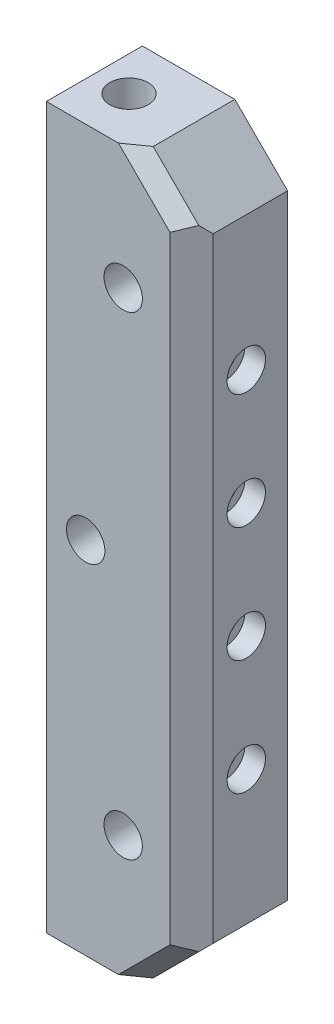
from build123d import *

# Parameters (mm, degrees)
SKICA1_W                 = 30.25
SKICA1_H                 = 150
VYSUNOUT1_DEPTH          = 20
ZKOSIT1_SIZE             = 11
ZKOSIT2_SIZE             = 4.5
ZKOSIT3_SIZE             = 3
SKICA2_W                 = 5.23
SKICA2_H                 = 125
ODEBRAT_VYSUNUT_M2_DEPTH = 1.4
SKICA4_R                 = 4
ODEBRAT_VYSUNUT_M3_DEPTH = 4.3
SKICA5_R                 = 2.2
ODEBRAT_VYSUNUT_M4_DEPTH = 154.536323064
SKICA6_R                 = 4
ODEBRAT_VYSUNUT_M5_DEPTH = 14
SKICA3_R                 = 4
ODEBRAT_VYSUNUT_M1_DEPTH = 10


with BuildPart() as part:
    # Skica1 → Vysunout1 (new body)
    with BuildSketch(Plane.XY):
        with Locations((15.125, 75)):
            Rectangle(SKICA1_W, SKICA1_H)
    extrude(amount=VYSUNOUT1_DEPTH)

    # Zkosit1
    zkosit1_edges = [part.edges().sort_by_distance(p)[0] for p in [
        (30.25, 150, 10),
        (30.25, 0, 10),
    ]]
    chamfer(zkosit1_edges, length=ZKOSIT1_SIZE)

    # Zkosit2
    zkosit2_edges = [part.edges().sort_by_distance(p)[0] for p in [
        (30.25, 75, 20),
    ]]
    chamfer(zkosit2_edges, length=ZKOSIT2_SIZE)

    # Zkosit3
    zkosit3_edges = [part.edges().sort_by_distance(p)[0] for p in [
        (22.5, 3.25, 20),
        (22.5, 146.75, 20),
    ]]
    chamfer(zkosit3_edges, length=ZKOSIT3_SIZE)

    # Skica2 → Odebrat vysunut_m2 (cut)
    with BuildSketch(Plane.ZY):
        with Locations((15.185, 62.5)):
            Rectangle(SKICA2_W, SKICA2_H)
    extrude(amount=-ODEBRAT_VYSUNUT_M2_DEPTH, mode=Mode.SUBTRACT)

    # Skica4 → Odebrat vysunut_m3 (cut)
    with BuildSketch(Plane(origin=(30.25, 0, 0), x_dir=(0, 0, -1), z_dir=(1, 0, 0))):
        with Locations((-8.612057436, 87)):
            Circle(SKICA4_R)
        with Locations((-8.612057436, 111)):
            Circle(SKICA4_R)
        with Locations((-8.612057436, 39)):
            Circle(SKICA4_R)
        with Locations((-8.612057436, 63)):
            Circle(SKICA4_R)
    extrude(amount=-ODEBRAT_VYSUNUT_M3_DEPTH, mode=Mode.SUBTRACT)

    # Skica5 → Odebrat vysunut_m4 (cut, through all)
    with BuildSketch(Plane(origin=(25.95, 0, 0), x_dir=(0, 0, -1), z_dir=(1, 0, 0))):
        with Locations((-8.612057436, 39)):
            Circle(SKICA5_R)
        with Locations((-8.612057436, 63)):
            Circle(SKICA5_R)
        with Locations((-8.612057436, 87)):
            Circle(SKICA5_R)
        with Locations((-8.612057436, 111)):
            Circle(SKICA5_R)
    extrude(amount=-ODEBRAT_VYSUNUT_M4_DEPTH, mode=Mode.SUBTRACT)

    # Skica6 → Odebrat vysunut_m5 (cut)
    with BuildSketch(Plane.XY.offset(20)):
        with Locations((8.185287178, 75)):
            Circle(SKICA6_R)
        with Locations((16, 124.385526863)):
            Circle(SKICA6_R)
        with Locations(Location((16, 25.614473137, 0), (0, 0, 180))):
            Circle(SKICA6_R)
    extrude(amount=-ODEBRAT_VYSUNUT_M5_DEPTH, mode=Mode.SUBTRACT)

    # Skica3 → Odebrat vysunut_m1 (cut)
    with BuildSketch(Plane.XZ):
        with Locations(Location((7.2, 10, 0), (0, 0, 270))):
            Circle(SKICA3_R)
    odebrat_vysunut_m1 = extrude(amount=-ODEBRAT_VYSUNUT_M1_DEPTH, mode=Mode.SUBTRACT)

    # Zrcadlit1: Odebrat vysunut_m1 across plane
    add(odebrat_vysunut_m1.mirror(Plane.ZX.offset(75)), mode=Mode.SUBTRACT)


solid = part.part
